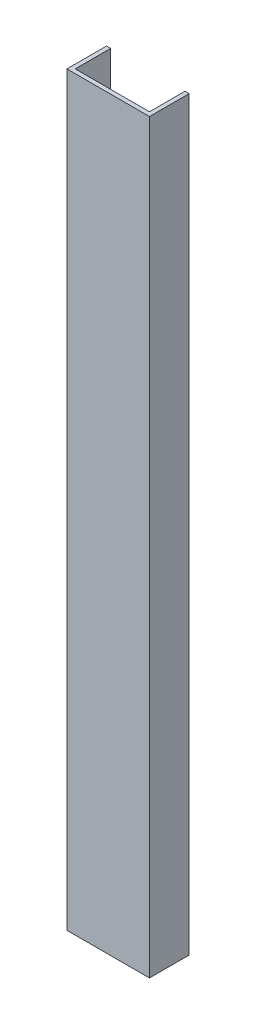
ISO-10303-21;
HEADER;
FILE_DESCRIPTION(('STEP AP214'),'2;1');
FILE_NAME('part.step','',(''),(''),'','','');
FILE_SCHEMA(('AUTOMOTIVE_DESIGN { 1 0 10303 214 1 1 1 1 }'));
ENDSEC;
DATA;
#1=APPLICATION_CONTEXT('core data for automotive mechanical design processes');
#2=APPLICATION_PROTOCOL_DEFINITION('international standard','automotive_design',2000,#1);
#3=PRODUCT_CONTEXT('',#1,'mechanical');
#4=PRODUCT('Part','Part','',(#3));
#5=PRODUCT_RELATED_PRODUCT_CATEGORY('part','',(#4));
#6=PRODUCT_DEFINITION_FORMATION('','',#4);
#7=PRODUCT_DEFINITION_CONTEXT('part definition',#1,'design');
#8=PRODUCT_DEFINITION('design','',#6,#7);
#9=PRODUCT_DEFINITION_SHAPE('','',#8);
#10=(LENGTH_UNIT() NAMED_UNIT(*) SI_UNIT(.MILLI.,.METRE.));
#11=(NAMED_UNIT(*) PLANE_ANGLE_UNIT() SI_UNIT($,.RADIAN.));
#12=(NAMED_UNIT(*) SI_UNIT($,.STERADIAN.) SOLID_ANGLE_UNIT());
#13=UNCERTAINTY_MEASURE_WITH_UNIT(LENGTH_MEASURE(1.E-05),#10,'distance_accuracy_value','');
#14=(GEOMETRIC_REPRESENTATION_CONTEXT(3) GLOBAL_UNCERTAINTY_ASSIGNED_CONTEXT((#13)) GLOBAL_UNIT_ASSIGNED_CONTEXT((#10,
#11,#12)) REPRESENTATION_CONTEXT('',''));
#15=CARTESIAN_POINT('',(0.,0.,0.));
#16=DIRECTION('',(0.,0.,1.));
#17=DIRECTION('',(1.,0.,0.));
#18=AXIS2_PLACEMENT_3D('',#15,#16,#17);
#19=CARTESIAN_POINT('',(45.,904.,-48.));
#20=DIRECTION('',(0.,0.,1.));
#21=DIRECTION('',(1.,0.,0.));
#22=AXIS2_PLACEMENT_3D('',#19,#20,#21);
#23=PLANE('',#22);
#24=DIRECTION('',(-1.,0.,0.));
#25=VECTOR('',#24,1.);
#26=CARTESIAN_POINT('',(45.,0.,-48.));
#27=LINE('',#26,#25);
#28=CARTESIAN_POINT('',(50.,0.,-48.));
#29=VERTEX_POINT('',#28);
#30=CARTESIAN_POINT('',(45.,0.,-48.));
#31=VERTEX_POINT('',#30);
#32=EDGE_CURVE('E128',#29,#31,#27,.T.);
#33=ORIENTED_EDGE('',*,*,#32,.T.);
#34=DIRECTION('',(0.,-1.,0.));
#35=VECTOR('',#34,1.);
#36=CARTESIAN_POINT('',(45.,904.,-48.));
#37=LINE('',#36,#35);
#38=CARTESIAN_POINT('',(45.,904.,-48.));
#39=VERTEX_POINT('',#38);
#40=EDGE_CURVE('E11',#39,#31,#37,.T.);
#41=ORIENTED_EDGE('',*,*,#40,.F.);
#42=DIRECTION('',(-1.,0.,0.));
#43=VECTOR('',#42,1.);
#44=CARTESIAN_POINT('',(45.,904.,-48.));
#45=LINE('',#44,#43);
#46=CARTESIAN_POINT('',(50.,904.,-48.));
#47=VERTEX_POINT('',#46);
#48=EDGE_CURVE('E142',#47,#39,#45,.T.);
#49=ORIENTED_EDGE('',*,*,#48,.F.);
#50=DIRECTION('',(0.,-1.,0.));
#51=VECTOR('',#50,1.);
#52=CARTESIAN_POINT('',(50.,904.,-48.));
#53=LINE('',#52,#51);
#54=EDGE_CURVE('E124',#47,#29,#53,.T.);
#55=ORIENTED_EDGE('',*,*,#54,.T.);
#56=EDGE_LOOP('',(#33,#41,#49,#55));
#57=FACE_BOUND('',#56,.T.);
#58=ADVANCED_FACE('F32',(#57),#23,.F.);
#59=CARTESIAN_POINT('',(45.,904.,-48.));
#60=DIRECTION('',(1.,0.,0.));
#61=DIRECTION('',(0.,0.,-1.));
#62=AXIS2_PLACEMENT_3D('',#59,#60,#61);
#63=PLANE('',#62);
#64=DIRECTION('',(0.,0.,1.));
#65=VECTOR('',#64,1.);
#66=CARTESIAN_POINT('',(45.,0.,-48.));
#67=LINE('',#66,#65);
#68=CARTESIAN_POINT('',(45.,0.,-4.99999999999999));
#69=VERTEX_POINT('',#68);
#70=EDGE_CURVE('E131',#31,#69,#67,.T.);
#71=ORIENTED_EDGE('',*,*,#70,.T.);
#72=DIRECTION('',(0.,-1.,0.));
#73=VECTOR('',#72,1.);
#74=CARTESIAN_POINT('',(45.,904.,-4.99999999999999));
#75=LINE('',#74,#73);
#76=CARTESIAN_POINT('',(45.,904.,-4.99999999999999));
#77=VERTEX_POINT('',#76);
#78=EDGE_CURVE('E40',#77,#69,#75,.T.);
#79=ORIENTED_EDGE('',*,*,#78,.F.);
#80=DIRECTION('',(0.,0.,1.));
#81=VECTOR('',#80,1.);
#82=CARTESIAN_POINT('',(45.,904.,-48.));
#83=LINE('',#82,#81);
#84=EDGE_CURVE('E91',#39,#77,#83,.T.);
#85=ORIENTED_EDGE('',*,*,#84,.F.);
#86=ORIENTED_EDGE('',*,*,#40,.T.);
#87=EDGE_LOOP('',(#71,#79,#85,#86));
#88=FACE_BOUND('',#87,.T.);
#89=ADVANCED_FACE('F177',(#88),#63,.F.);
#90=CARTESIAN_POINT('',(45.,904.,-4.99999999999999));
#91=DIRECTION('',(0.,0.,1.));
#92=DIRECTION('',(1.,0.,0.));
#93=AXIS2_PLACEMENT_3D('',#90,#91,#92);
#94=PLANE('',#93);
#95=DIRECTION('',(-1.,0.,0.));
#96=VECTOR('',#95,1.);
#97=CARTESIAN_POINT('',(45.,0.,-4.99999999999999));
#98=LINE('',#97,#96);
#99=CARTESIAN_POINT('',(-45.,0.,-4.99999999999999));
#100=VERTEX_POINT('',#99);
#101=EDGE_CURVE('E133',#69,#100,#98,.T.);
#102=ORIENTED_EDGE('',*,*,#101,.T.);
#103=DIRECTION('',(0.,-1.,0.));
#104=VECTOR('',#103,1.);
#105=CARTESIAN_POINT('',(-45.,904.,-4.99999999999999));
#106=LINE('',#105,#104);
#107=CARTESIAN_POINT('',(-45.,904.,-4.99999999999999));
#108=VERTEX_POINT('',#107);
#109=EDGE_CURVE('E149',#108,#100,#106,.T.);
#110=ORIENTED_EDGE('',*,*,#109,.F.);
#111=DIRECTION('',(-1.,0.,0.));
#112=VECTOR('',#111,1.);
#113=CARTESIAN_POINT('',(45.,904.,-4.99999999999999));
#114=LINE('',#113,#112);
#115=EDGE_CURVE('E157',#77,#108,#114,.T.);
#116=ORIENTED_EDGE('',*,*,#115,.F.);
#117=ORIENTED_EDGE('',*,*,#78,.T.);
#118=EDGE_LOOP('',(#102,#110,#116,#117));
#119=FACE_BOUND('',#118,.T.);
#120=ADVANCED_FACE('F155',(#119),#94,.F.);
#121=CARTESIAN_POINT('',(-45.,904.,-4.99999999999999));
#122=DIRECTION('',(-1.,0.,0.));
#123=DIRECTION('',(0.,0.,1.));
#124=AXIS2_PLACEMENT_3D('',#121,#122,#123);
#125=PLANE('',#124);
#126=DIRECTION('',(0.,0.,-1.));
#127=VECTOR('',#126,1.);
#128=CARTESIAN_POINT('',(-45.,0.,-4.99999999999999));
#129=LINE('',#128,#127);
#130=CARTESIAN_POINT('',(-45.,0.,-48.));
#131=VERTEX_POINT('',#130);
#132=EDGE_CURVE('E135',#100,#131,#129,.T.);
#133=ORIENTED_EDGE('',*,*,#132,.T.);
#134=DIRECTION('',(0.,-1.,0.));
#135=VECTOR('',#134,1.);
#136=CARTESIAN_POINT('',(-45.,904.,-48.));
#137=LINE('',#136,#135);
#138=CARTESIAN_POINT('',(-45.,904.,-48.));
#139=VERTEX_POINT('',#138);
#140=EDGE_CURVE('E146',#139,#131,#137,.T.);
#141=ORIENTED_EDGE('',*,*,#140,.F.);
#142=DIRECTION('',(0.,0.,-1.));
#143=VECTOR('',#142,1.);
#144=CARTESIAN_POINT('',(-45.,904.,-4.99999999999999));
#145=LINE('',#144,#143);
#146=EDGE_CURVE('E169',#108,#139,#145,.T.);
#147=ORIENTED_EDGE('',*,*,#146,.F.);
#148=ORIENTED_EDGE('',*,*,#109,.T.);
#149=EDGE_LOOP('',(#133,#141,#147,#148));
#150=FACE_BOUND('',#149,.T.);
#151=ADVANCED_FACE('F165',(#150),#125,.F.);
#152=CARTESIAN_POINT('',(-50.,904.,-48.));
#153=DIRECTION('',(0.,0.,1.));
#154=DIRECTION('',(1.,0.,0.));
#155=AXIS2_PLACEMENT_3D('',#152,#153,#154);
#156=PLANE('',#155);
#157=DIRECTION('',(-1.,0.,0.));
#158=VECTOR('',#157,1.);
#159=CARTESIAN_POINT('',(-50.,0.,-48.));
#160=LINE('',#159,#158);
#161=CARTESIAN_POINT('',(-50.,0.,-48.));
#162=VERTEX_POINT('',#161);
#163=EDGE_CURVE('E137',#131,#162,#160,.T.);
#164=ORIENTED_EDGE('',*,*,#163,.T.);
#165=DIRECTION('',(0.,-1.,0.));
#166=VECTOR('',#165,1.);
#167=CARTESIAN_POINT('',(-50.,904.,-48.));
#168=LINE('',#167,#166);
#169=CARTESIAN_POINT('',(-50.,904.,-48.));
#170=VERTEX_POINT('',#169);
#171=EDGE_CURVE('E119',#170,#162,#168,.T.);
#172=ORIENTED_EDGE('',*,*,#171,.F.);
#173=DIRECTION('',(-1.,0.,0.));
#174=VECTOR('',#173,1.);
#175=CARTESIAN_POINT('',(-50.,904.,-48.));
#176=LINE('',#175,#174);
#177=EDGE_CURVE('E110',#139,#170,#176,.T.);
#178=ORIENTED_EDGE('',*,*,#177,.F.);
#179=ORIENTED_EDGE('',*,*,#140,.T.);
#180=EDGE_LOOP('',(#164,#172,#178,#179));
#181=FACE_BOUND('',#180,.T.);
#182=ADVANCED_FACE('F168',(#181),#156,.F.);
#183=CARTESIAN_POINT('',(-50.,904.,0.));
#184=DIRECTION('',(1.,0.,0.));
#185=DIRECTION('',(0.,0.,-1.));
#186=AXIS2_PLACEMENT_3D('',#183,#184,#185);
#187=PLANE('',#186);
#188=DIRECTION('',(0.,0.,1.));
#189=VECTOR('',#188,1.);
#190=CARTESIAN_POINT('',(-50.,0.,0.));
#191=LINE('',#190,#189);
#192=CARTESIAN_POINT('',(-50.,0.,0.));
#193=VERTEX_POINT('',#192);
#194=EDGE_CURVE('E118',#162,#193,#191,.T.);
#195=ORIENTED_EDGE('',*,*,#194,.T.);
#196=DIRECTION('',(0.,-1.,0.));
#197=VECTOR('',#196,1.);
#198=CARTESIAN_POINT('',(-50.,904.,0.));
#199=LINE('',#198,#197);
#200=CARTESIAN_POINT('',(-50.,904.,0.));
#201=VERTEX_POINT('',#200);
#202=EDGE_CURVE('E115',#201,#193,#199,.T.);
#203=ORIENTED_EDGE('',*,*,#202,.F.);
#204=DIRECTION('',(0.,0.,1.));
#205=VECTOR('',#204,1.);
#206=CARTESIAN_POINT('',(-50.,904.,0.));
#207=LINE('',#206,#205);
#208=EDGE_CURVE('E104',#170,#201,#207,.T.);
#209=ORIENTED_EDGE('',*,*,#208,.F.);
#210=ORIENTED_EDGE('',*,*,#171,.T.);
#211=EDGE_LOOP('',(#195,#203,#209,#210));
#212=FACE_BOUND('',#211,.T.);
#213=ADVANCED_FACE('F116',(#212),#187,.F.);
#214=CARTESIAN_POINT('',(-50.,904.,0.));
#215=DIRECTION('',(0.,0.,-1.));
#216=DIRECTION('',(-1.,0.,0.));
#217=AXIS2_PLACEMENT_3D('',#214,#215,#216);
#218=PLANE('',#217);
#219=DIRECTION('',(1.,0.,0.));
#220=VECTOR('',#219,1.);
#221=CARTESIAN_POINT('',(-50.,0.,0.));
#222=LINE('',#221,#220);
#223=CARTESIAN_POINT('',(50.,0.,0.));
#224=VERTEX_POINT('',#223);
#225=EDGE_CURVE('E77',#193,#224,#222,.T.);
#226=ORIENTED_EDGE('',*,*,#225,.T.);
#227=DIRECTION('',(0.,-1.,0.));
#228=VECTOR('',#227,1.);
#229=CARTESIAN_POINT('',(50.,904.,0.));
#230=LINE('',#229,#228);
#231=CARTESIAN_POINT('',(50.,904.,0.));
#232=VERTEX_POINT('',#231);
#233=EDGE_CURVE('E120',#232,#224,#230,.T.);
#234=ORIENTED_EDGE('',*,*,#233,.F.);
#235=DIRECTION('',(1.,0.,0.));
#236=VECTOR('',#235,1.);
#237=CARTESIAN_POINT('',(-50.,904.,0.));
#238=LINE('',#237,#236);
#239=EDGE_CURVE('E108',#201,#232,#238,.T.);
#240=ORIENTED_EDGE('',*,*,#239,.F.);
#241=ORIENTED_EDGE('',*,*,#202,.T.);
#242=EDGE_LOOP('',(#226,#234,#240,#241));
#243=FACE_BOUND('',#242,.T.);
#244=ADVANCED_FACE('F122',(#243),#218,.F.);
#245=CARTESIAN_POINT('',(50.,904.,0.));
#246=DIRECTION('',(-1.,0.,0.));
#247=DIRECTION('',(0.,0.,1.));
#248=AXIS2_PLACEMENT_3D('',#245,#246,#247);
#249=PLANE('',#248);
#250=DIRECTION('',(0.,0.,-1.));
#251=VECTOR('',#250,1.);
#252=CARTESIAN_POINT('',(50.,0.,0.));
#253=LINE('',#252,#251);
#254=EDGE_CURVE('E83',#224,#29,#253,.T.);
#255=ORIENTED_EDGE('',*,*,#254,.T.);
#256=ORIENTED_EDGE('',*,*,#54,.F.);
#257=DIRECTION('',(0.,0.,-1.));
#258=VECTOR('',#257,1.);
#259=CARTESIAN_POINT('',(50.,904.,0.));
#260=LINE('',#259,#258);
#261=EDGE_CURVE('E48',#232,#47,#260,.T.);
#262=ORIENTED_EDGE('',*,*,#261,.F.);
#263=ORIENTED_EDGE('',*,*,#233,.T.);
#264=EDGE_LOOP('',(#255,#256,#262,#263));
#265=FACE_BOUND('',#264,.T.);
#266=ADVANCED_FACE('F193',(#265),#249,.F.);
#267=CARTESIAN_POINT('',(0.,904.,0.));
#268=DIRECTION('',(0.,1.,0.));
#269=DIRECTION('',(0.,0.,1.));
#270=AXIS2_PLACEMENT_3D('',#267,#268,#269);
#271=PLANE('',#270);
#272=ORIENTED_EDGE('',*,*,#48,.T.);
#273=ORIENTED_EDGE('',*,*,#84,.T.);
#274=ORIENTED_EDGE('',*,*,#115,.T.);
#275=ORIENTED_EDGE('',*,*,#146,.T.);
#276=ORIENTED_EDGE('',*,*,#177,.T.);
#277=ORIENTED_EDGE('',*,*,#208,.T.);
#278=ORIENTED_EDGE('',*,*,#239,.T.);
#279=ORIENTED_EDGE('',*,*,#261,.T.);
#280=EDGE_LOOP('',(#272,#273,#274,#275,#276,#277,#278,#279));
#281=FACE_BOUND('',#280,.T.);
#282=ADVANCED_FACE('F106',(#281),#271,.T.);
#283=CARTESIAN_POINT('',(0.,0.,0.));
#284=DIRECTION('',(0.,1.,0.));
#285=DIRECTION('',(0.,0.,1.));
#286=AXIS2_PLACEMENT_3D('',#283,#284,#285);
#287=PLANE('',#286);
#288=ORIENTED_EDGE('',*,*,#32,.F.);
#289=ORIENTED_EDGE('',*,*,#254,.F.);
#290=ORIENTED_EDGE('',*,*,#225,.F.);
#291=ORIENTED_EDGE('',*,*,#194,.F.);
#292=ORIENTED_EDGE('',*,*,#163,.F.);
#293=ORIENTED_EDGE('',*,*,#132,.F.);
#294=ORIENTED_EDGE('',*,*,#101,.F.);
#295=ORIENTED_EDGE('',*,*,#70,.F.);
#296=EDGE_LOOP('',(#288,#289,#290,#291,#292,#293,#294,#295));
#297=FACE_BOUND('',#296,.T.);
#298=ADVANCED_FACE('F161',(#297),#287,.F.);
#299=CLOSED_SHELL('',(#58,#89,#120,#151,#182,#213,#244,#266,#282,#298));
#300=MANIFOLD_SOLID_BREP('B2',#299);
#301=ADVANCED_BREP_SHAPE_REPRESENTATION('',(#18,#300),#14);
#302=SHAPE_DEFINITION_REPRESENTATION(#9,#301);
ENDSEC;
END-ISO-10303-21;
